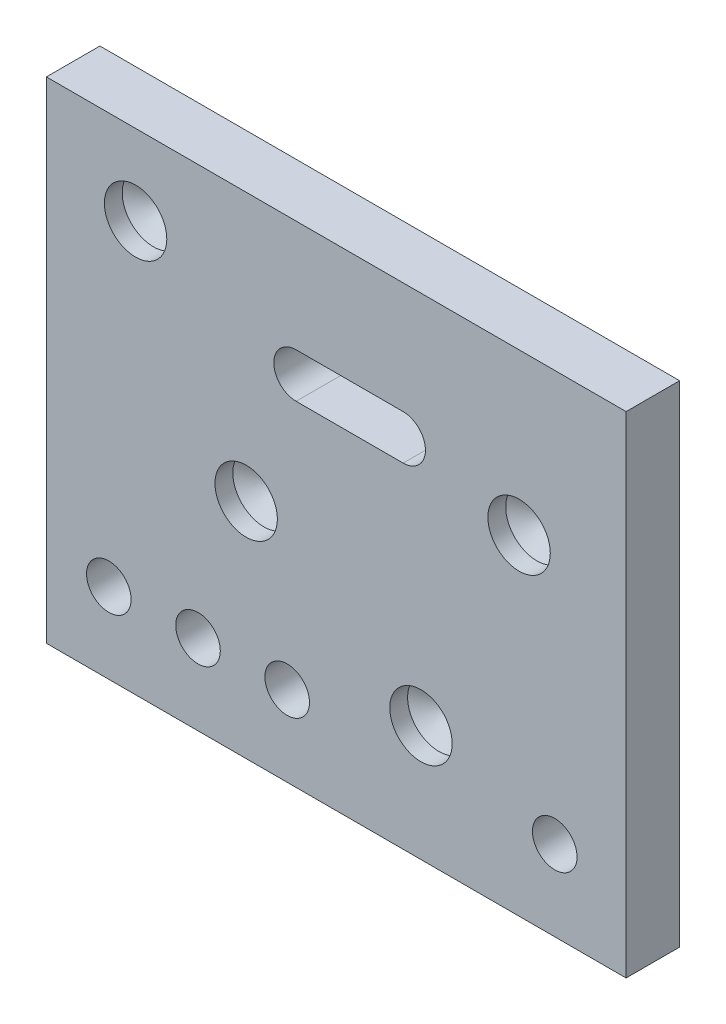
from build123d import *

# Parameters (mm, degrees)
SKETCH1_W                        = 325
SKETCH1_H                        = 275
EXTRUDE1_DEPTH                   = 30
M25_0_25_000000_DIAMETER_HOLE1_D = 25
LPATTERN1_COUNT                  = 6
LPATTERN1_PITCH                  = 50
CUT_EXTRUDE1_DEPTH               = 427.790346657


with BuildPart() as part:
    # Sketch1 → Extrude1 (new body)
    with BuildSketch(Plane.XY):
        with Locations((162.5, 137.5)):
            Rectangle(SKETCH1_W, SKETCH1_H)
    extrude(amount=EXTRUDE1_DEPTH)

    # M25.0 _25.000000_ Diameter Hole1 (through all)
    with Locations(Plane.XY.offset(30)):
        with Locations((35, 45)):
            m25_0_25_000000_diameter_hole1 = Hole(M25_0_25_000000_DIAMETER_HOLE1_D / 2)

    # LPattern1: M25.0 _25.000000_ Diameter Hole1 ×6, 2 skipped
    with Locations(*[(i * LPATTERN1_PITCH, 0, 0) for i in range(1, LPATTERN1_COUNT) if i not in (3, 4)]):
        add(m25_0_25_000000_diameter_hole1, mode=Mode.SUBTRACT)

    # Sketch6 → Tap Drill for M39x4.0 Tap1 (revolve, cut)
    with BuildSketch(Plane(origin=(50, 230, 30), x_dir=(0, -1, 0), z_dir=(1, 0, 0))):
        Polygon((0, 0), (0, 20.515060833), (17.5, 10), (17.5, 0), align=None)
    tap_drill_for_m39x4_0_tap1 = revolve(axis=Axis((50, 230, 36.35), (0, 0, -1)), mode=Mode.SUBTRACT)

    # Sketch-Pattern1: Tap Drill for M39x4.0 Tap1 at 3 more places
    with Locations((62, -105, 0), (215, -45, 0), (160, -165, 0)):
        add(tap_drill_for_m39x4_0_tap1, mode=Mode.SUBTRACT)

    # Sketch9 → Cut-Extrude1 (cut, through all)
    with BuildSketch(Plane.XY.offset(30)):
        with BuildLine():
            Line((140, 212.5), (200, 212.5))
            ThreePointArc((200, 212.5), (212.5, 200), (200, 187.5))
            Line((200, 187.5), (140, 187.5))
            ThreePointArc((140, 187.5), (127.5, 200), (140, 212.5))
        make_face()
    extrude(amount=-CUT_EXTRUDE1_DEPTH, mode=Mode.SUBTRACT)


solid = part.part
